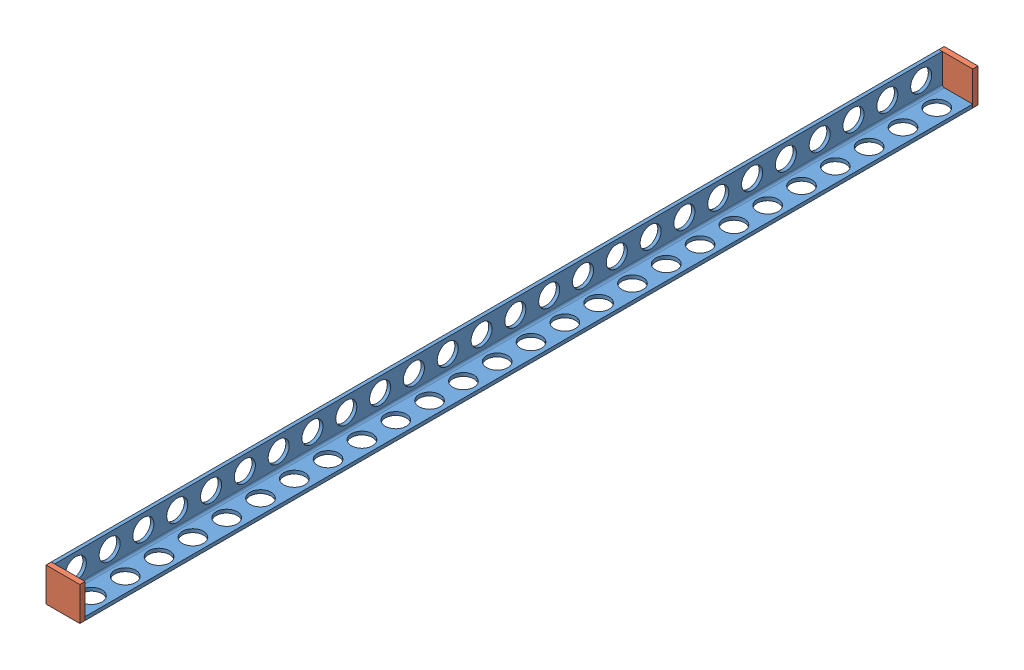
SolidWorks assembly L BEAM.SLDASM, configuration Default (file format 4100). Lengths in mm.
Overall size (80 80 2125).
3 component instances, 2 part files, 6 mates.
Components (placement in the parent):
- L beam-1: L beam.SLDPRT [Default] at origin size (80 80 2100)
- endplate-1: endplate.SLDPRT [Default] at (-40 0 2100) size (80 80 12.5)
- endplate-2: endplate.SLDPRT [Default] at (-40 0 -12.5) size (80 80 12.5)
Mates (geometry in assembly coordinates):
- Coincident1: coincident anti-aligned: plane of L beam-1 through (-40 0 2100) normal (0 0 1); plane of endplate-1 through (-40 80 2100) normal (0 0 -1)
- Coincident2: coincident aligned: plane of L beam-1 through (-40 80 2100) normal (-1 0 0); plane of endplate-1 through (-40 0 2112.5) normal (-1 0 0)
- Coincident3: coincident aligned: plane of L beam-1 through (-40 0 2100) normal (0 -1 0); plane of endplate-1 through (-40 0 2112.5) normal (0 -1 0)
- Coincident4: coincident anti-aligned: plane of L beam-1 through (-40 0 0) normal (0 0 -1); plane of endplate-2 through (-40 80 0) normal (0 0 1)
- Coincident5: coincident aligned: plane of L beam-1 through (-40 80 2100) normal (-1 0 0); plane of endplate-2 through (-40 0 0) normal (-1 0 0)
- Coincident6: coincident aligned: plane of L beam-1 through (-40 0 2100) normal (0 -1 0); plane of endplate-2 through (-40 0 0) normal (0 -1 0)
